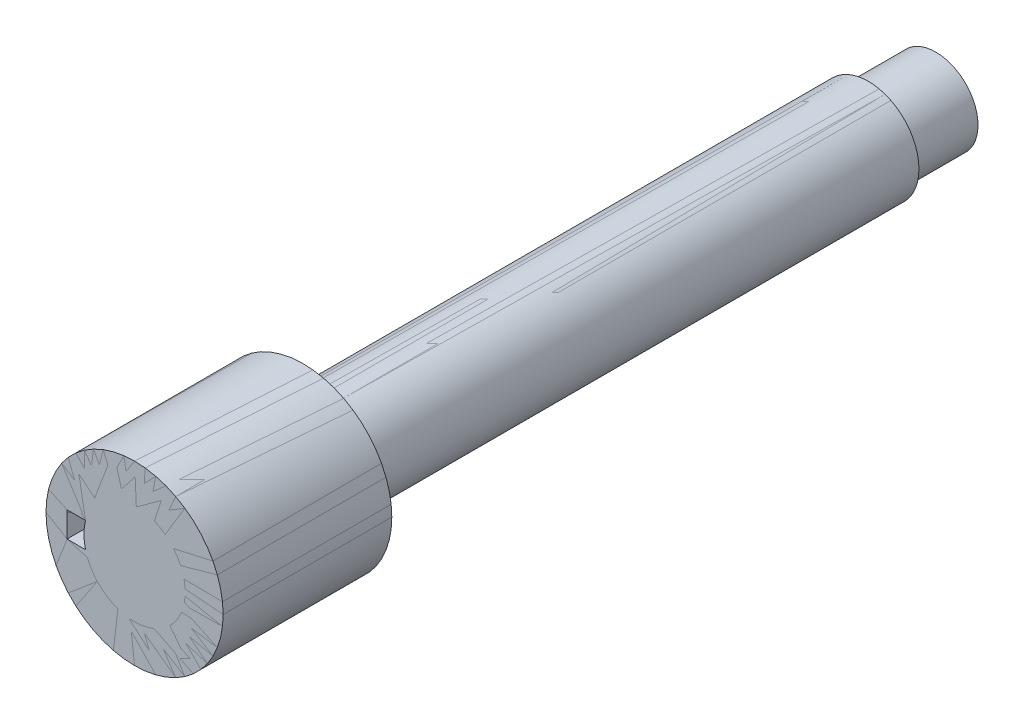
ISO-10303-21;
HEADER;
FILE_DESCRIPTION(('STEP AP214'),'2;1');
FILE_NAME('part.step','',(''),(''),'','','');
FILE_SCHEMA(('AUTOMOTIVE_DESIGN { 1 0 10303 214 1 1 1 1 }'));
ENDSEC;
DATA;
#1=APPLICATION_CONTEXT('core data for automotive mechanical design processes');
#2=APPLICATION_PROTOCOL_DEFINITION('international standard','automotive_design',2000,#1);
#3=PRODUCT_CONTEXT('',#1,'mechanical');
#4=PRODUCT('Part','Part','',(#3));
#5=PRODUCT_RELATED_PRODUCT_CATEGORY('part','',(#4));
#6=PRODUCT_DEFINITION_FORMATION('','',#4);
#7=PRODUCT_DEFINITION_CONTEXT('part definition',#1,'design');
#8=PRODUCT_DEFINITION('design','',#6,#7);
#9=PRODUCT_DEFINITION_SHAPE('','',#8);
#10=(LENGTH_UNIT() NAMED_UNIT(*) SI_UNIT(.MILLI.,.METRE.));
#11=(NAMED_UNIT(*) PLANE_ANGLE_UNIT() SI_UNIT($,.RADIAN.));
#12=(NAMED_UNIT(*) SI_UNIT($,.STERADIAN.) SOLID_ANGLE_UNIT());
#13=UNCERTAINTY_MEASURE_WITH_UNIT(LENGTH_MEASURE(1.E-05),#10,'distance_accuracy_value','');
#14=(GEOMETRIC_REPRESENTATION_CONTEXT(3) GLOBAL_UNCERTAINTY_ASSIGNED_CONTEXT((#13)) GLOBAL_UNIT_ASSIGNED_CONTEXT((#10,
#11,#12)) REPRESENTATION_CONTEXT('',''));
#15=CARTESIAN_POINT('',(0.,0.,0.));
#16=DIRECTION('',(0.,0.,1.));
#17=DIRECTION('',(1.,0.,0.));
#18=AXIS2_PLACEMENT_3D('',#15,#16,#17);
#19=CARTESIAN_POINT('',(0.,10.,-182.));
#20=DIRECTION('',(0.,0.,1.));
#21=DIRECTION('',(1.,0.,0.));
#22=AXIS2_PLACEMENT_3D('',#19,#20,#21);
#23=PLANE('',#22);
#24=CARTESIAN_POINT('',(0.,0.,-182.));
#25=DIRECTION('',(0.,0.,1.));
#26=DIRECTION('',(1.,0.,0.));
#27=AXIS2_PLACEMENT_3D('',#24,#25,#26);
#28=CIRCLE('',#27,12.);
#29=CARTESIAN_POINT('',(12.,0.,-182.));
#30=VERTEX_POINT('',#29);
#31=EDGE_CURVE('P0_E39',#30,#30,#28,.T.);
#32=ORIENTED_EDGE('',*,*,#31,.F.);
#33=EDGE_LOOP('',(#32));
#34=FACE_BOUND('',#33,.T.);
#35=CARTESIAN_POINT('',(0.,0.,-182.));
#36=DIRECTION('',(0.,0.,1.));
#37=DIRECTION('',(1.,0.,0.));
#38=AXIS2_PLACEMENT_3D('',#35,#36,#37);
#39=CIRCLE('',#38,10.);
#40=CARTESIAN_POINT('',(10.,0.,-182.));
#41=VERTEX_POINT('',#40);
#42=EDGE_CURVE('P0_E11',#41,#41,#39,.F.);
#43=ORIENTED_EDGE('',*,*,#42,.F.);
#44=EDGE_LOOP('',(#43));
#45=FACE_BOUND('',#44,.T.);
#46=ADVANCED_FACE('P0_F30',(#34,#45),#23,.F.);
#47=CARTESIAN_POINT('',(-10.,0.,0.));
#48=DIRECTION('',(1.,0.,0.));
#49=DIRECTION('',(0.,0.,-1.));
#50=AXIS2_PLACEMENT_3D('',#47,#48,#49);
#51=PLANE('',#50);
#52=DIRECTION('',(0.,0.,-1.));
#53=VECTOR('',#52,1.);
#54=CARTESIAN_POINT('',(-10.,3.,-50.));
#55=LINE('',#54,#53);
#56=CARTESIAN_POINT('',(-10.,2.99999999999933,-50.));
#57=VERTEX_POINT('',#56);
#58=CARTESIAN_POINT('',(-10.,3.,-43.));
#59=VERTEX_POINT('',#58);
#60=EDGE_CURVE('P0_E62',#57,#59,#55,.F.);
#61=ORIENTED_EDGE('',*,*,#60,.F.);
#62=CARTESIAN_POINT('',(-10.,-1.3433698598E-12,-50.));
#63=DIRECTION('',(1.,0.,0.));
#64=DIRECTION('',(0.,0.,-1.));
#65=AXIS2_PLACEMENT_3D('',#62,#63,#64);
#66=CIRCLE('',#65,3.);
#67=CARTESIAN_POINT('',(-10.,-3.00000000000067,-50.));
#68=VERTEX_POINT('',#67);
#69=EDGE_CURVE('P0_E170',#57,#68,#66,.F.);
#70=ORIENTED_EDGE('',*,*,#69,.T.);
#71=DIRECTION('',(0.,0.,1.));
#72=VECTOR('',#71,1.);
#73=CARTESIAN_POINT('',(-10.,-3.,-8.));
#74=LINE('',#73,#72);
#75=CARTESIAN_POINT('',(-10.,-3.,-43.));
#76=VERTEX_POINT('',#75);
#77=EDGE_CURVE('P0_E141',#76,#68,#74,.F.);
#78=ORIENTED_EDGE('',*,*,#77,.F.);
#79=DIRECTION('',(0.,1.,0.));
#80=VECTOR('',#79,1.);
#81=CARTESIAN_POINT('',(-10.,0.,-43.));
#82=LINE('',#81,#80);
#83=EDGE_CURVE('P0_E70',#59,#76,#82,.F.);
#84=ORIENTED_EDGE('',*,*,#83,.F.);
#85=EDGE_LOOP('',(#61,#70,#78,#84));
#86=FACE_BOUND('',#85,.T.);
#87=ADVANCED_FACE('P0_F237',(#86),#51,.F.);
#88=CARTESIAN_POINT('',(-10.,3.,-50.));
#89=DIRECTION('',(0.,-1.,0.));
#90=DIRECTION('',(0.,0.,-1.));
#91=AXIS2_PLACEMENT_3D('',#88,#89,#90);
#92=PLANE('',#91);
#93=DIRECTION('',(1.,0.,0.));
#94=VECTOR('',#93,1.);
#95=CARTESIAN_POINT('',(0.,3.,-43.));
#96=LINE('',#95,#94);
#97=CARTESIAN_POINT('',(-11.6189500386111,3.,-43.));
#98=VERTEX_POINT('',#97);
#99=EDGE_CURVE('P0_E121',#98,#59,#96,.T.);
#100=ORIENTED_EDGE('',*,*,#99,.F.);
#101=DIRECTION('',(0.,0.,-1.));
#102=VECTOR('',#101,1.);
#103=CARTESIAN_POINT('',(-11.6189500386,3.,-50.));
#104=LINE('',#103,#102);
#105=CARTESIAN_POINT('',(-11.6189500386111,3.,-7.99999999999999));
#106=VERTEX_POINT('',#105);
#107=EDGE_CURVE('P0_E107',#98,#106,#104,.F.);
#108=ORIENTED_EDGE('',*,*,#107,.T.);
#109=DIRECTION('',(1.,0.,0.));
#110=VECTOR('',#109,1.);
#111=CARTESIAN_POINT('',(0.,3.,-8.));
#112=LINE('',#111,#110);
#113=CARTESIAN_POINT('',(-16.,3.,-8.));
#114=VERTEX_POINT('',#113);
#115=EDGE_CURVE('P0_E117',#114,#106,#112,.T.);
#116=ORIENTED_EDGE('',*,*,#115,.F.);
#117=DIRECTION('',(0.,0.,-1.));
#118=VECTOR('',#117,1.);
#119=CARTESIAN_POINT('',(-16.,3.,0.));
#120=LINE('',#119,#118);
#121=CARTESIAN_POINT('',(-16.,2.99999999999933,-50.));
#122=VERTEX_POINT('',#121);
#123=EDGE_CURVE('P0_E152',#122,#114,#120,.F.);
#124=ORIENTED_EDGE('',*,*,#123,.F.);
#125=DIRECTION('',(1.,0.,0.));
#126=VECTOR('',#125,1.);
#127=CARTESIAN_POINT('',(-13.,2.99999999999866,-50.));
#128=LINE('',#127,#126);
#129=EDGE_CURVE('P0_E181',#122,#57,#128,.T.);
#130=ORIENTED_EDGE('',*,*,#129,.T.);
#131=ORIENTED_EDGE('',*,*,#60,.T.);
#132=EDGE_LOOP('',(#100,#108,#116,#124,#130,#131));
#133=FACE_BOUND('',#132,.T.);
#134=ADVANCED_FACE('P0_F125',(#133),#92,.T.);
#135=CARTESIAN_POINT('',(0.,21.,-8.));
#136=DIRECTION('',(0.,0.,1.));
#137=DIRECTION('',(1.,0.,0.));
#138=AXIS2_PLACEMENT_3D('',#135,#136,#137);
#139=PLANE('',#138);
#140=CARTESIAN_POINT('',(0.,0.,-7.99999999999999));
#141=DIRECTION('',(0.,0.,1.));
#142=DIRECTION('',(1.,0.,0.));
#143=AXIS2_PLACEMENT_3D('',#140,#141,#142);
#144=CIRCLE('',#143,11.9999999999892);
#145=CARTESIAN_POINT('',(-11.6189500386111,-3.,-7.99999999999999));
#146=VERTEX_POINT('',#145);
#147=EDGE_CURVE('P0_E112',#146,#106,#144,.T.);
#148=ORIENTED_EDGE('',*,*,#147,.F.);
#149=DIRECTION('',(1.,0.,0.));
#150=VECTOR('',#149,1.);
#151=CARTESIAN_POINT('',(-10.,-3.,-8.));
#152=LINE('',#151,#150);
#153=CARTESIAN_POINT('',(-16.,-3.,-8.));
#154=VERTEX_POINT('',#153);
#155=EDGE_CURVE('P0_E90',#154,#146,#152,.T.);
#156=ORIENTED_EDGE('',*,*,#155,.F.);
#157=DIRECTION('',(0.,1.,0.));
#158=VECTOR('',#157,1.);
#159=CARTESIAN_POINT('',(-16.,0.,-8.));
#160=LINE('',#159,#158);
#161=EDGE_CURVE('P0_E149',#114,#154,#160,.F.);
#162=ORIENTED_EDGE('',*,*,#161,.F.);
#163=ORIENTED_EDGE('',*,*,#115,.T.);
#164=EDGE_LOOP('',(#148,#156,#162,#163));
#165=FACE_BOUND('',#164,.T.);
#166=CARTESIAN_POINT('',(0.,0.,-7.99999999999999));
#167=DIRECTION('',(0.,0.,1.));
#168=DIRECTION('',(1.,0.,0.));
#169=AXIS2_PLACEMENT_3D('',#166,#167,#168);
#170=CIRCLE('',#169,21.);
#171=CARTESIAN_POINT('',(21.,0.,-7.99999999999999));
#172=VERTEX_POINT('',#171);
#173=EDGE_CURVE('P0_E184',#172,#172,#170,.F.);
#174=ORIENTED_EDGE('',*,*,#173,.F.);
#175=EDGE_LOOP('',(#174));
#176=FACE_BOUND('',#175,.T.);
#177=ADVANCED_FACE('P0_F232',(#165,#176),#139,.T.);
#178=CARTESIAN_POINT('',(-10.,-3.,-8.));
#179=DIRECTION('',(0.,1.,0.));
#180=DIRECTION('',(0.,0.,1.));
#181=AXIS2_PLACEMENT_3D('',#178,#179,#180);
#182=PLANE('',#181);
#183=DIRECTION('',(0.,0.,1.));
#184=VECTOR('',#183,1.);
#185=CARTESIAN_POINT('',(-11.6189500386,-3.,-8.));
#186=LINE('',#185,#184);
#187=CARTESIAN_POINT('',(-11.6189500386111,-3.,-43.));
#188=VERTEX_POINT('',#187);
#189=EDGE_CURVE('P0_E173',#146,#188,#186,.F.);
#190=ORIENTED_EDGE('',*,*,#189,.T.);
#191=DIRECTION('',(1.,0.,0.));
#192=VECTOR('',#191,1.);
#193=CARTESIAN_POINT('',(0.,-3.,-43.));
#194=LINE('',#193,#192);
#195=EDGE_CURVE('P0_E122',#76,#188,#194,.F.);
#196=ORIENTED_EDGE('',*,*,#195,.F.);
#197=ORIENTED_EDGE('',*,*,#77,.T.);
#198=DIRECTION('',(1.,0.,0.));
#199=VECTOR('',#198,1.);
#200=CARTESIAN_POINT('',(-13.,-3.00000000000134,-50.));
#201=LINE('',#200,#199);
#202=CARTESIAN_POINT('',(-16.,-3.00000000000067,-50.));
#203=VERTEX_POINT('',#202);
#204=EDGE_CURVE('P0_E83',#68,#203,#201,.F.);
#205=ORIENTED_EDGE('',*,*,#204,.T.);
#206=DIRECTION('',(0.,0.,-1.));
#207=VECTOR('',#206,1.);
#208=CARTESIAN_POINT('',(-16.,-3.,0.));
#209=LINE('',#208,#207);
#210=EDGE_CURVE('P0_E144',#154,#203,#209,.T.);
#211=ORIENTED_EDGE('',*,*,#210,.F.);
#212=ORIENTED_EDGE('',*,*,#155,.T.);
#213=EDGE_LOOP('',(#190,#196,#197,#205,#211,#212));
#214=FACE_BOUND('',#213,.T.);
#215=ADVANCED_FACE('P0_F228',(#214),#182,.T.);
#216=CARTESIAN_POINT('',(0.,0.,-123.098076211));
#217=DIRECTION('',(0.,0.,1.));
#218=DIRECTION('',(1.,0.,0.));
#219=AXIS2_PLACEMENT_3D('',#216,#217,#218);
#220=CYLINDRICAL_SURFACE('',#219,21.);
#221=ORIENTED_EDGE('',*,*,#173,.T.);
#222=EDGE_LOOP('',(#221));
#223=FACE_BOUND('',#222,.T.);
#224=CARTESIAN_POINT('',(0.,0.,-47.9999999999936));
#225=DIRECTION('',(0.,0.,1.));
#226=DIRECTION('',(-0.479425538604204,0.877582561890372,0.));
#227=AXIS2_PLACEMENT_3D('',#224,#225,#226);
#228=CIRCLE('',#227,21.0000000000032);
#229=CARTESIAN_POINT('',(-10.0679363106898,18.4292337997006,-47.9999999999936));
#230=VERTEX_POINT('',#229);
#231=EDGE_CURVE('P0_E163',#230,#230,#228,.F.);
#232=ORIENTED_EDGE('',*,*,#231,.F.);
#233=EDGE_LOOP('',(#232));
#234=FACE_BOUND('',#233,.T.);
#235=ADVANCED_FACE('P0_F225',(#223,#234),#220,.T.);
#236=CARTESIAN_POINT('',(-13.,-1.3433698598E-12,-50.));
#237=DIRECTION('',(1.,0.,0.));
#238=DIRECTION('',(0.,0.,-1.));
#239=AXIS2_PLACEMENT_3D('',#236,#237,#238);
#240=CYLINDRICAL_SURFACE('',#239,3.);
#241=CARTESIAN_POINT('',(-16.,-1.3433698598E-12,-50.));
#242=DIRECTION('',(1.,0.,0.));
#243=DIRECTION('',(0.,0.,-1.));
#244=AXIS2_PLACEMENT_3D('',#241,#242,#243);
#245=CIRCLE('',#244,3.);
#246=CARTESIAN_POINT('',(-15.9999999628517,-2.75998137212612,-51.175798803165));
#247=VERTEX_POINT('',#246);
#248=EDGE_CURVE('P0_E148',#203,#247,#245,.T.);
#249=ORIENTED_EDGE('',*,*,#248,.F.);
#250=ORIENTED_EDGE('',*,*,#204,.F.);
#251=ORIENTED_EDGE('',*,*,#69,.F.);
#252=ORIENTED_EDGE('',*,*,#129,.F.);
#253=CARTESIAN_POINT('',(-16.,-1.3433698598E-12,-50.));
#254=DIRECTION('',(1.,0.,0.));
#255=DIRECTION('',(0.,0.,-1.));
#256=AXIS2_PLACEMENT_3D('',#253,#254,#255);
#257=CIRCLE('',#256,3.);
#258=CARTESIAN_POINT('',(-16.,2.75998135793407,-51.1757987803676));
#259=VERTEX_POINT('',#258);
#260=EDGE_CURVE('P0_E47',#259,#122,#257,.T.);
#261=ORIENTED_EDGE('',*,*,#260,.F.);
#262=CARTESIAN_POINT('',(-15.9999999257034,-2.75998136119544,-51.1757988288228));
#263=CARTESIAN_POINT('',(-15.9309307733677,-2.73966577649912,-51.2234764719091));
#264=CARTESIAN_POINT('',(-15.8622271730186,-2.71793414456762,-51.271071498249));
#265=CARTESIAN_POINT('',(-15.725651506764,-2.67146931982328,-51.3660349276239));
#266=CARTESIAN_POINT('',(-15.6577797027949,-2.64673520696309,-51.413403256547));
#267=CARTESIAN_POINT('',(-15.4548932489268,-2.56750856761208,-51.55554559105));
#268=CARTESIAN_POINT('',(-15.3213616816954,-2.50820902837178,-51.6498365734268));
#269=CARTESIAN_POINT('',(-15.0576236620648,-2.37417611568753,-51.8376151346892));
#270=CARTESIAN_POINT('',(-14.9275113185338,-2.29919923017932,-51.9310623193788));
#271=CARTESIAN_POINT('',(-14.6755467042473,-2.13254954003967,-52.1136382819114));
#272=CARTESIAN_POINT('',(-14.5536737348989,-2.04092088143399,-52.2027777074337));
#273=CARTESIAN_POINT('',(-14.3888878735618,-1.89744045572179,-52.3243916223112));
#274=CARTESIAN_POINT('',(-14.3412214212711,-1.8533901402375,-52.3597114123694));
#275=CARTESIAN_POINT('',(-14.2482390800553,-1.76178249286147,-52.4288715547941));
#276=CARTESIAN_POINT('',(-14.2029232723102,-1.71422503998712,-52.4627118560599));
#277=CARTESIAN_POINT('',(-14.0712958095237,-1.5663252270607,-52.5613793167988));
#278=CARTESIAN_POINT('',(-13.9890050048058,-1.46050065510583,-52.6235741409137));
#279=CARTESIAN_POINT('',(-13.8380629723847,-1.2319104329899,-52.738414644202));
#280=CARTESIAN_POINT('',(-13.769620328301,-1.10892703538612,-52.7909133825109));
#281=CARTESIAN_POINT('',(-13.6822764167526,-0.913846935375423,-52.8582551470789));
#282=CARTESIAN_POINT('',(-13.6557222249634,-0.847079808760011,-52.8787957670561));
#283=CARTESIAN_POINT('',(-13.6083374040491,-0.710411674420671,-52.9155307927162));
#284=CARTESIAN_POINT('',(-13.587504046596,-0.640512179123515,-52.9317272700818));
#285=CARTESIAN_POINT('',(-13.5447311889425,-0.468154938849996,-52.9650319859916));
#286=CARTESIAN_POINT('',(-13.5260149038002,-0.364373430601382,-52.9796562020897));
#287=CARTESIAN_POINT('',(-13.5027028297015,-0.154327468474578,-52.9978808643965));
#288=CARTESIAN_POINT('',(-13.4980993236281,-0.0480644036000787,-53.0014873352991));
#289=CARTESIAN_POINT('',(-13.5033301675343,0.163922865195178,-52.9973939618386));
#290=CARTESIAN_POINT('',(-13.5131698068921,0.269646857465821,-52.989689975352));
#291=CARTESIAN_POINT('',(-13.5465737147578,0.477531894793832,-52.9636052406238));
#292=CARTESIAN_POINT('',(-13.5701435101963,0.579691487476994,-52.9452201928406));
#293=CARTESIAN_POINT('',(-13.6299030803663,0.779563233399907,-52.8987877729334));
#294=CARTESIAN_POINT('',(-13.6662711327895,0.877189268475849,-52.8706039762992));
#295=CARTESIAN_POINT('',(-13.7495708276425,1.06498520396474,-52.8063633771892));
#296=CARTESIAN_POINT('',(-13.7965064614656,1.15515226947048,-52.7703036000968));
#297=CARTESIAN_POINT('',(-13.92950300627,1.37872341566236,-52.6686890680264));
#298=CARTESIAN_POINT('',(-14.0222392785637,1.50597892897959,-52.5983410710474));
#299=CARTESIAN_POINT('',(-14.2232421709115,1.74071438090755,-52.4473484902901));
#300=CARTESIAN_POINT('',(-14.3315554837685,1.8481325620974,-52.3666730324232));
#301=CARTESIAN_POINT('',(-14.5353619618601,2.02445325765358,-52.2163181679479));
#302=CARTESIAN_POINT('',(-14.6288697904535,2.09672612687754,-52.1478180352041));
#303=CARTESIAN_POINT('',(-14.8211084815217,2.2309885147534,-52.0080075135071));
#304=CARTESIAN_POINT('',(-14.9198428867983,2.29297093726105,-51.9366952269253));
#305=CARTESIAN_POINT('',(-15.1213156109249,2.40761367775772,-51.7921791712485));
#306=CARTESIAN_POINT('',(-15.2240563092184,2.46026834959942,-51.7189742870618));
#307=CARTESIAN_POINT('',(-15.4325554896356,2.5570600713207,-51.5713775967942));
#308=CARTESIAN_POINT('',(-15.5383126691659,2.60120073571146,-51.4969863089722));
#309=CARTESIAN_POINT('',(-15.7038195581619,2.66350246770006,-51.3812732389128));
#310=CARTESIAN_POINT('',(-15.7627460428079,2.6843848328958,-51.340210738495));
#311=CARTESIAN_POINT('',(-15.8810260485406,2.72385267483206,-51.2580515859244));
#312=CARTESIAN_POINT('',(-15.9403774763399,2.74244561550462,-51.2169555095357));
#313=CARTESIAN_POINT('',(-15.9999999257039,2.75998136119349,-51.1757988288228));
#314=B_SPLINE_CURVE_WITH_KNOTS('',3,(#262,#263,#264,#265,#266,#267,#268,#269,#270,#271,#272,
#273,#274,#275,#276,#277,#278,#279,#280,#281,#282,#283,#284,#285,#286,#287,#288,#289,#290,#291,
#292,#293,#294,#295,#296,#297,#298,#299,#300,#301,#302,#303,#304,#305,#306,#307,#308,#309,#310,
#311,#312,#313),.UNSPECIFIED.,.F.,.F.,(4,2,2,2,2,2,2,2,2,2,2,2,2,2,2,2,2,2,2,2,2,2,2,2,2,4),(0.,
0.259025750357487,0.518131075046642,1.03915973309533,1.56897891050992,2.09741343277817,
2.31897362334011,2.54054146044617,2.98233451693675,3.4303542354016,3.65419596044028,
3.87793074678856,4.19580853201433,4.51351246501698,4.83133277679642,5.14928111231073,
5.47184618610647,5.79453329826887,6.30898324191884,6.82500871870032,7.2342493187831,
7.64377096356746,8.05353965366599,8.46313399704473,8.6874927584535,8.91109953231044),.UNSPECIFIED.);
#315=EDGE_CURVE('P0_E167',#247,#259,#314,.T.);
#316=ORIENTED_EDGE('',*,*,#315,.F.);
#317=EDGE_LOOP('',(#249,#250,#251,#252,#261,#316));
#318=FACE_BOUND('',#317,.T.);
#319=ADVANCED_FACE('P0_F220',(#318),#240,.F.);
#320=CARTESIAN_POINT('',(-16.,0.,0.));
#321=DIRECTION('',(1.,0.,0.));
#322=DIRECTION('',(0.,0.,-1.));
#323=AXIS2_PLACEMENT_3D('',#320,#321,#322);
#324=PLANE('',#323);
#325=ORIENTED_EDGE('',*,*,#248,.T.);
#326=CARTESIAN_POINT('',(-16.,2.75998133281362,-51.175798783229));
#327=CARTESIAN_POINT('',(-16.,2.53058008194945,-51.2018013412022));
#328=CARTESIAN_POINT('',(-16.,2.30083283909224,-51.2246834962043));
#329=CARTESIAN_POINT('',(-16.,1.84078348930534,-51.2640482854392));
#330=CARTESIAN_POINT('',(-16.,1.61048136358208,-51.2805306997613));
#331=CARTESIAN_POINT('',(-16.,0.920517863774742,-51.3200493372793));
#332=CARTESIAN_POINT('',(-16.,0.460258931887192,-51.3333333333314));
#333=CARTESIAN_POINT('',(-16.,-0.460258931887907,-51.3333333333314));
#334=CARTESIAN_POINT('',(-16.,-0.920517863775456,-51.3200493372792));
#335=CARTESIAN_POINT('',(-16.,-1.6104813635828,-51.2805306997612));
#336=CARTESIAN_POINT('',(-16.,-1.84078348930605,-51.2640482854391));
#337=CARTESIAN_POINT('',(-16.,-2.30083283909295,-51.2246834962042));
#338=CARTESIAN_POINT('',(-16.,-2.53058008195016,-51.2018013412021));
#339=CARTESIAN_POINT('',(-16.,-2.75998133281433,-51.175798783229));
#340=B_SPLINE_CURVE_WITH_KNOTS('',3,(#326,#327,#328,#329,#330,#331,#332,#333,#334,#335,#336,
#337,#338,#339),.UNSPECIFIED.,.F.,.F.,(4,2,2,2,2,2,4),(0.,0.692571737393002,1.38516727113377,
2.76571360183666,4.14625993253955,4.83885546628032,5.53142720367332),.UNSPECIFIED.);
#341=EDGE_CURVE('P0_E162',#259,#247,#340,.T.);
#342=ORIENTED_EDGE('',*,*,#341,.F.);
#343=ORIENTED_EDGE('',*,*,#260,.T.);
#344=ORIENTED_EDGE('',*,*,#123,.T.);
#345=ORIENTED_EDGE('',*,*,#161,.T.);
#346=ORIENTED_EDGE('',*,*,#210,.T.);
#347=EDGE_LOOP('',(#325,#342,#343,#344,#345,#346));
#348=FACE_BOUND('',#347,.T.);
#349=ADVANCED_FACE('P0_F217',(#348),#324,.T.);
#350=CARTESIAN_POINT('',(0.,0.,-47.9999999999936));
#351=DIRECTION('',(0.,0.,1.));
#352=DIRECTION('',(1.,0.,0.));
#353=AXIS2_PLACEMENT_3D('',#350,#351,#352);
#354=CONICAL_SURFACE('',#353,21.0000000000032,0.982793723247);
#355=ORIENTED_EDGE('',*,*,#231,.T.);
#356=EDGE_LOOP('',(#355));
#357=FACE_BOUND('',#356,.T.);
#358=ORIENTED_EDGE('',*,*,#315,.T.);
#359=ORIENTED_EDGE('',*,*,#341,.T.);
#360=EDGE_LOOP('',(#358,#359));
#361=FACE_BOUND('',#360,.T.);
#362=CARTESIAN_POINT('',(0.,0.,-54.));
#363=DIRECTION('',(0.,0.,1.));
#364=DIRECTION('',(1.,0.,0.));
#365=AXIS2_PLACEMENT_3D('',#362,#363,#364);
#366=CIRCLE('',#365,12.);
#367=CARTESIAN_POINT('',(12.,0.,-54.));
#368=VERTEX_POINT('',#367);
#369=EDGE_CURVE('P0_E158',#368,#368,#366,.F.);
#370=ORIENTED_EDGE('',*,*,#369,.F.);
#371=EDGE_LOOP('',(#370));
#372=FACE_BOUND('',#371,.T.);
#373=ADVANCED_FACE('P0_F215',(#357,#361,#372),#354,.T.);
#374=CARTESIAN_POINT('',(0.,0.,-123.098076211));
#375=DIRECTION('',(0.,0.,1.));
#376=DIRECTION('',(1.,0.,0.));
#377=AXIS2_PLACEMENT_3D('',#374,#375,#376);
#378=CYLINDRICAL_SURFACE('',#377,12.);
#379=ORIENTED_EDGE('',*,*,#369,.T.);
#380=EDGE_LOOP('',(#379));
#381=FACE_BOUND('',#380,.T.);
#382=ORIENTED_EDGE('',*,*,#31,.T.);
#383=EDGE_LOOP('',(#382));
#384=FACE_BOUND('',#383,.T.);
#385=ADVANCED_FACE('P0_F32',(#381,#384),#378,.T.);
#386=CARTESIAN_POINT('',(0.,0.,-198.));
#387=DIRECTION('',(0.,0.,1.));
#388=DIRECTION('',(1.,0.,0.));
#389=AXIS2_PLACEMENT_3D('',#386,#387,#388);
#390=CYLINDRICAL_SURFACE('',#389,10.);
#391=CARTESIAN_POINT('',(0.,0.,-198.));
#392=DIRECTION('',(0.,0.,-1.));
#393=DIRECTION('',(-1.,0.,0.));
#394=AXIS2_PLACEMENT_3D('',#391,#392,#393);
#395=CIRCLE('',#394,10.);
#396=CARTESIAN_POINT('',(-10.,0.,-198.));
#397=VERTEX_POINT('',#396);
#398=EDGE_CURVE('P0_E127',#397,#397,#395,.T.);
#399=ORIENTED_EDGE('',*,*,#398,.F.);
#400=EDGE_LOOP('',(#399));
#401=FACE_BOUND('',#400,.T.);
#402=ORIENTED_EDGE('',*,*,#42,.T.);
#403=EDGE_LOOP('',(#402));
#404=FACE_BOUND('',#403,.T.);
#405=ADVANCED_FACE('P0_F240',(#401,#404),#390,.T.);
#406=CARTESIAN_POINT('',(0.,0.,-198.));
#407=DIRECTION('',(0.,0.,-1.));
#408=DIRECTION('',(-1.,0.,0.));
#409=AXIS2_PLACEMENT_3D('',#406,#407,#408);
#410=PLANE('',#409);
#411=ORIENTED_EDGE('',*,*,#398,.T.);
#412=EDGE_LOOP('',(#411));
#413=FACE_BOUND('',#412,.T.);
#414=ADVANCED_FACE('P0_F262',(#413),#410,.T.);
#415=CARTESIAN_POINT('',(11.9999999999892,0.,-43.));
#416=DIRECTION('',(0.,0.,-1.));
#417=DIRECTION('',(-1.,0.,0.));
#418=AXIS2_PLACEMENT_3D('',#415,#416,#417);
#419=PLANE('',#418);
#420=ORIENTED_EDGE('',*,*,#99,.T.);
#421=ORIENTED_EDGE('',*,*,#83,.T.);
#422=ORIENTED_EDGE('',*,*,#195,.T.);
#423=CARTESIAN_POINT('',(0.,0.,-43.));
#424=DIRECTION('',(0.,0.,1.));
#425=DIRECTION('',(1.,0.,0.));
#426=AXIS2_PLACEMENT_3D('',#423,#424,#425);
#427=CIRCLE('',#426,11.9999999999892);
#428=EDGE_CURVE('P0_E110',#188,#98,#427,.T.);
#429=ORIENTED_EDGE('',*,*,#428,.T.);
#430=EDGE_LOOP('',(#420,#421,#422,#429));
#431=FACE_BOUND('',#430,.T.);
#432=CARTESIAN_POINT('',(0.,0.,-43.));
#433=DIRECTION('',(0.,0.,-1.));
#434=DIRECTION('',(-1.,0.,0.));
#435=AXIS2_PLACEMENT_3D('',#432,#433,#434);
#436=CIRCLE('',#435,3.00000000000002);
#437=CARTESIAN_POINT('',(-3.00000000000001,0.,-43.));
#438=VERTEX_POINT('',#437);
#439=EDGE_CURVE('P0_E123',#438,#438,#436,.F.);
#440=ORIENTED_EDGE('',*,*,#439,.F.);
#441=EDGE_LOOP('',(#440));
#442=FACE_BOUND('',#441,.T.);
#443=ADVANCED_FACE('P0_F119',(#431,#442),#419,.F.);
#444=CARTESIAN_POINT('',(0.,0.,-43.));
#445=DIRECTION('',(0.,0.,1.));
#446=DIRECTION('',(1.,0.,0.));
#447=AXIS2_PLACEMENT_3D('',#444,#445,#446);
#448=CYLINDRICAL_SURFACE('',#447,11.9999999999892);
#449=ORIENTED_EDGE('',*,*,#107,.F.);
#450=ORIENTED_EDGE('',*,*,#428,.F.);
#451=ORIENTED_EDGE('',*,*,#189,.F.);
#452=ORIENTED_EDGE('',*,*,#147,.T.);
#453=EDGE_LOOP('',(#449,#450,#451,#452));
#454=FACE_BOUND('',#453,.T.);
#455=ADVANCED_FACE('P0_F109',(#454),#448,.F.);
#456=CARTESIAN_POINT('',(0.,0.,-48.1961524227));
#457=CARTESIAN_POINT('',(0.,1.36034952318,-47.4107542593));
#458=CARTESIAN_POINT('',(0.,2.44947111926,-46.1462536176));
#459=CARTESIAN_POINT('',(0.,3.,-44.5707963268));
#460=CARTESIAN_POINT('',(0.,3.,-43.));
#461=(BOUNDED_CURVE() B_SPLINE_CURVE(4,(#456,#457,#458,#459,#460),.UNSPECIFIED.,.F.,
.F.) B_SPLINE_CURVE_WITH_KNOTS((5,5),(3.14159265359,9.42477796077),
.UNSPECIFIED.) CURVE() GEOMETRIC_REPRESENTATION_ITEM() RATIONAL_B_SPLINE_CURVE((1.,1.,1.,1.,1.)) REPRESENTATION_ITEM(''));
#462=CARTESIAN_POINT('',(0.,0.,-123.098076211));
#463=DIRECTION('',(0.,0.,-1.));
#464=AXIS1_PLACEMENT('',#462,#463);
#465=SURFACE_OF_REVOLUTION('',#461,#464);
#466=ORIENTED_EDGE('',*,*,#439,.T.);
#467=EDGE_LOOP('',(#466));
#468=FACE_BOUND('',#467,.T.);
#469=CARTESIAN_POINT('',(0.,0.,-48.1961524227));
#470=VERTEX_POINT('',#469);
#471=VERTEX_LOOP('',#470);
#472=FACE_BOUND('',#471,.T.);
#473=ADVANCED_FACE('P0_F241',(#468,#472),#465,.T.);
#474=CLOSED_SHELL('',(#46,#87,#134,#177,#215,#235,#319,#349,#373,#385,#405,#414,#443,#455,#473));
#475=MANIFOLD_SOLID_BREP('P0_B2',#474);
#476=CARTESIAN_POINT('',(-10.,0.,0.));
#477=DIRECTION('',(1.,0.,0.));
#478=DIRECTION('',(0.,0.,-1.));
#479=AXIS2_PLACEMENT_3D('',#476,#477,#478);
#480=PLANE('',#479);
#481=DIRECTION('',(0.,0.,-1.));
#482=VECTOR('',#481,1.);
#483=CARTESIAN_POINT('',(-10.,3.,-50.));
#484=LINE('',#483,#482);
#485=CARTESIAN_POINT('',(-10.,2.99999999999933,-50.));
#486=VERTEX_POINT('',#485);
#487=CARTESIAN_POINT('',(-10.,3.,-43.));
#488=VERTEX_POINT('',#487);
#489=EDGE_CURVE('P1_E236',#486,#488,#484,.F.);
#490=ORIENTED_EDGE('',*,*,#489,.F.);
#491=CARTESIAN_POINT('',(-10.,-1.3433698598E-12,-50.));
#492=DIRECTION('',(1.,0.,0.));
#493=DIRECTION('',(0.,0.,-1.));
#494=AXIS2_PLACEMENT_3D('',#491,#492,#493);
#495=CIRCLE('',#494,3.);
#496=CARTESIAN_POINT('',(-10.,-3.00000000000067,-50.));
#497=VERTEX_POINT('',#496);
#498=EDGE_CURVE('P1_E213',#486,#497,#495,.F.);
#499=ORIENTED_EDGE('',*,*,#498,.T.);
#500=DIRECTION('',(0.,0.,1.));
#501=VECTOR('',#500,1.);
#502=CARTESIAN_POINT('',(-10.,-3.,-8.));
#503=LINE('',#502,#501);
#504=CARTESIAN_POINT('',(-10.,-3.,-43.));
#505=VERTEX_POINT('',#504);
#506=EDGE_CURVE('P1_E216',#505,#497,#503,.F.);
#507=ORIENTED_EDGE('',*,*,#506,.F.);
#508=DIRECTION('',(0.,1.,0.));
#509=VECTOR('',#508,1.);
#510=CARTESIAN_POINT('',(-10.,0.,-43.));
#511=LINE('',#510,#509);
#512=EDGE_CURVE('P1_E76',#488,#505,#511,.F.);
#513=ORIENTED_EDGE('',*,*,#512,.F.);
#514=EDGE_LOOP('',(#490,#499,#507,#513));
#515=FACE_BOUND('',#514,.T.);
#516=ADVANCED_FACE('P1_F17',(#515),#480,.F.);
#517=CARTESIAN_POINT('',(-10.,3.,-50.));
#518=DIRECTION('',(0.,-1.,0.));
#519=DIRECTION('',(0.,0.,-1.));
#520=AXIS2_PLACEMENT_3D('',#517,#518,#519);
#521=PLANE('',#520);
#522=DIRECTION('',(1.,0.,0.));
#523=VECTOR('',#522,1.);
#524=CARTESIAN_POINT('',(0.,3.,-43.));
#525=LINE('',#524,#523);
#526=CARTESIAN_POINT('',(-11.6189500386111,3.,-43.));
#527=VERTEX_POINT('',#526);
#528=EDGE_CURVE('P1_E69',#527,#488,#525,.T.);
#529=ORIENTED_EDGE('',*,*,#528,.F.);
#530=DIRECTION('',(0.,0.,-1.));
#531=VECTOR('',#530,1.);
#532=CARTESIAN_POINT('',(-11.6189500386,3.,-50.));
#533=LINE('',#532,#531);
#534=CARTESIAN_POINT('',(-11.6189500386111,3.,-8.));
#535=VERTEX_POINT('',#534);
#536=EDGE_CURVE('P1_E62',#527,#535,#533,.F.);
#537=ORIENTED_EDGE('',*,*,#536,.T.);
#538=DIRECTION('',(1.,0.,0.));
#539=VECTOR('',#538,1.);
#540=CARTESIAN_POINT('',(0.,3.,-8.));
#541=LINE('',#540,#539);
#542=CARTESIAN_POINT('',(-16.,3.,-8.));
#543=VERTEX_POINT('',#542);
#544=EDGE_CURVE('P1_E233',#543,#535,#541,.T.);
#545=ORIENTED_EDGE('',*,*,#544,.F.);
#546=DIRECTION('',(0.,0.,-1.));
#547=VECTOR('',#546,1.);
#548=CARTESIAN_POINT('',(-16.,3.,0.));
#549=LINE('',#548,#547);
#550=CARTESIAN_POINT('',(-16.,2.99999999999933,-50.));
#551=VERTEX_POINT('',#550);
#552=EDGE_CURVE('P1_E224',#551,#543,#549,.F.);
#553=ORIENTED_EDGE('',*,*,#552,.F.);
#554=DIRECTION('',(1.,0.,0.));
#555=VECTOR('',#554,1.);
#556=CARTESIAN_POINT('',(-13.,2.99999999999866,-50.));
#557=LINE('',#556,#555);
#558=EDGE_CURVE('P1_E227',#551,#486,#557,.T.);
#559=ORIENTED_EDGE('',*,*,#558,.T.);
#560=ORIENTED_EDGE('',*,*,#489,.T.);
#561=EDGE_LOOP('',(#529,#537,#545,#553,#559,#560));
#562=FACE_BOUND('',#561,.T.);
#563=ADVANCED_FACE('P1_F139',(#562),#521,.T.);
#564=CARTESIAN_POINT('',(0.,21.,-8.));
#565=DIRECTION('',(0.,0.,1.));
#566=DIRECTION('',(1.,0.,0.));
#567=AXIS2_PLACEMENT_3D('',#564,#565,#566);
#568=PLANE('',#567);
#569=DIRECTION('',(0.,1.,0.));
#570=VECTOR('',#569,1.);
#571=CARTESIAN_POINT('',(-16.,0.,-8.));
#572=LINE('',#571,#570);
#573=CARTESIAN_POINT('',(-16.,-3.,-8.));
#574=VERTEX_POINT('',#573);
#575=EDGE_CURVE('P1_E219',#543,#574,#572,.F.);
#576=ORIENTED_EDGE('',*,*,#575,.F.);
#577=ORIENTED_EDGE('',*,*,#544,.T.);
#578=CARTESIAN_POINT('',(0.,0.,-7.99999999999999));
#579=DIRECTION('',(0.,0.,1.));
#580=DIRECTION('',(1.,0.,0.));
#581=AXIS2_PLACEMENT_3D('',#578,#579,#580);
#582=CIRCLE('',#581,11.9999999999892);
#583=CARTESIAN_POINT('',(-11.6189500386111,-3.,-8.));
#584=VERTEX_POINT('',#583);
#585=EDGE_CURVE('P1_E115',#535,#584,#582,.T.);
#586=ORIENTED_EDGE('',*,*,#585,.T.);
#587=DIRECTION('',(1.,0.,0.));
#588=VECTOR('',#587,1.);
#589=CARTESIAN_POINT('',(-10.,-3.,-8.));
#590=LINE('',#589,#588);
#591=EDGE_CURVE('P1_E94',#574,#584,#590,.T.);
#592=ORIENTED_EDGE('',*,*,#591,.F.);
#593=EDGE_LOOP('',(#576,#577,#586,#592));
#594=FACE_BOUND('',#593,.T.);
#595=CARTESIAN_POINT('',(0.,0.,-7.99999999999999));
#596=DIRECTION('',(0.,0.,1.));
#597=DIRECTION('',(1.,0.,0.));
#598=AXIS2_PLACEMENT_3D('',#595,#596,#597);
#599=CIRCLE('',#598,21.);
#600=CARTESIAN_POINT('',(21.,0.,-7.99999999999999));
#601=VERTEX_POINT('',#600);
#602=EDGE_CURVE('P1_E106',#601,#601,#599,.F.);
#603=ORIENTED_EDGE('',*,*,#602,.F.);
#604=EDGE_LOOP('',(#603));
#605=FACE_BOUND('',#604,.T.);
#606=ADVANCED_FACE('P1_F142',(#594,#605),#568,.T.);
#607=CARTESIAN_POINT('',(-10.,-3.,-8.));
#608=DIRECTION('',(0.,1.,0.));
#609=DIRECTION('',(0.,0.,1.));
#610=AXIS2_PLACEMENT_3D('',#607,#608,#609);
#611=PLANE('',#610);
#612=DIRECTION('',(0.,0.,1.));
#613=VECTOR('',#612,1.);
#614=CARTESIAN_POINT('',(-11.6189500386,-3.,-8.));
#615=LINE('',#614,#613);
#616=CARTESIAN_POINT('',(-11.6189500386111,-3.,-43.));
#617=VERTEX_POINT('',#616);
#618=EDGE_CURVE('P1_E98',#584,#617,#615,.F.);
#619=ORIENTED_EDGE('',*,*,#618,.T.);
#620=DIRECTION('',(1.,0.,0.));
#621=VECTOR('',#620,1.);
#622=CARTESIAN_POINT('',(0.,-3.,-43.));
#623=LINE('',#622,#621);
#624=EDGE_CURVE('P1_E101',#505,#617,#623,.F.);
#625=ORIENTED_EDGE('',*,*,#624,.F.);
#626=ORIENTED_EDGE('',*,*,#506,.T.);
#627=DIRECTION('',(1.,0.,0.));
#628=VECTOR('',#627,1.);
#629=CARTESIAN_POINT('',(-13.,-3.00000000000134,-50.));
#630=LINE('',#629,#628);
#631=CARTESIAN_POINT('',(-16.,-3.00000000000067,-50.));
#632=VERTEX_POINT('',#631);
#633=EDGE_CURVE('P1_E87',#497,#632,#630,.F.);
#634=ORIENTED_EDGE('',*,*,#633,.T.);
#635=DIRECTION('',(0.,0.,-1.));
#636=VECTOR('',#635,1.);
#637=CARTESIAN_POINT('',(-16.,-3.,0.));
#638=LINE('',#637,#636);
#639=EDGE_CURVE('P1_E223',#574,#632,#638,.T.);
#640=ORIENTED_EDGE('',*,*,#639,.F.);
#641=ORIENTED_EDGE('',*,*,#591,.T.);
#642=EDGE_LOOP('',(#619,#625,#626,#634,#640,#641));
#643=FACE_BOUND('',#642,.T.);
#644=ADVANCED_FACE('P1_F100',(#643),#611,.T.);
#645=CARTESIAN_POINT('',(0.,0.,-123.098076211));
#646=DIRECTION('',(0.,0.,1.));
#647=DIRECTION('',(1.,0.,0.));
#648=AXIS2_PLACEMENT_3D('',#645,#646,#647);
#649=CYLINDRICAL_SURFACE('',#648,21.);
#650=ORIENTED_EDGE('',*,*,#602,.T.);
#651=EDGE_LOOP('',(#650));
#652=FACE_BOUND('',#651,.T.);
#653=CARTESIAN_POINT('',(0.,0.,-47.9999999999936));
#654=DIRECTION('',(0.,0.,1.));
#655=DIRECTION('',(-0.479425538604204,0.877582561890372,0.));
#656=AXIS2_PLACEMENT_3D('',#653,#654,#655);
#657=CIRCLE('',#656,21.0000000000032);
#658=CARTESIAN_POINT('',(-10.0679363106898,18.4292337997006,-47.9999999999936));
#659=VERTEX_POINT('',#658);
#660=EDGE_CURVE('P1_E168',#659,#659,#657,.F.);
#661=ORIENTED_EDGE('',*,*,#660,.F.);
#662=EDGE_LOOP('',(#661));
#663=FACE_BOUND('',#662,.T.);
#664=ADVANCED_FACE('P1_F147',(#652,#663),#649,.T.);
#665=CARTESIAN_POINT('',(-13.,-1.3433698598E-12,-50.));
#666=DIRECTION('',(1.,0.,0.));
#667=DIRECTION('',(0.,0.,-1.));
#668=AXIS2_PLACEMENT_3D('',#665,#666,#667);
#669=CYLINDRICAL_SURFACE('',#668,3.);
#670=CARTESIAN_POINT('',(-16.,-1.3433698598E-12,-50.));
#671=DIRECTION('',(1.,0.,0.));
#672=DIRECTION('',(0.,0.,-1.));
#673=AXIS2_PLACEMENT_3D('',#670,#671,#672);
#674=CIRCLE('',#673,3.);
#675=CARTESIAN_POINT('',(-15.9999999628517,-2.75998137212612,-51.175798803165));
#676=VERTEX_POINT('',#675);
#677=EDGE_CURVE('P1_E172',#632,#676,#674,.T.);
#678=ORIENTED_EDGE('',*,*,#677,.F.);
#679=ORIENTED_EDGE('',*,*,#633,.F.);
#680=ORIENTED_EDGE('',*,*,#498,.F.);
#681=ORIENTED_EDGE('',*,*,#558,.F.);
#682=CARTESIAN_POINT('',(-16.,-1.3433698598E-12,-50.));
#683=DIRECTION('',(1.,0.,0.));
#684=DIRECTION('',(0.,0.,-1.));
#685=AXIS2_PLACEMENT_3D('',#682,#683,#684);
#686=CIRCLE('',#685,3.);
#687=CARTESIAN_POINT('',(-16.,2.75998135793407,-51.1757987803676));
#688=VERTEX_POINT('',#687);
#689=EDGE_CURVE('P1_E38',#688,#551,#686,.T.);
#690=ORIENTED_EDGE('',*,*,#689,.F.);
#691=CARTESIAN_POINT('',(-15.9999999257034,-2.75998136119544,-51.1757988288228));
#692=CARTESIAN_POINT('',(-15.9309307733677,-2.73966577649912,-51.2234764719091));
#693=CARTESIAN_POINT('',(-15.8622271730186,-2.71793414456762,-51.271071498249));
#694=CARTESIAN_POINT('',(-15.725651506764,-2.67146931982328,-51.3660349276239));
#695=CARTESIAN_POINT('',(-15.6577797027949,-2.64673520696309,-51.413403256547));
#696=CARTESIAN_POINT('',(-15.4548932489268,-2.56750856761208,-51.55554559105));
#697=CARTESIAN_POINT('',(-15.3213616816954,-2.50820902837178,-51.6498365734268));
#698=CARTESIAN_POINT('',(-15.0576236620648,-2.37417611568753,-51.8376151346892));
#699=CARTESIAN_POINT('',(-14.9275113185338,-2.29919923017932,-51.9310623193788));
#700=CARTESIAN_POINT('',(-14.6755467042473,-2.13254954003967,-52.1136382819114));
#701=CARTESIAN_POINT('',(-14.5536737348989,-2.04092088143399,-52.2027777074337));
#702=CARTESIAN_POINT('',(-14.3888878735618,-1.89744045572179,-52.3243916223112));
#703=CARTESIAN_POINT('',(-14.3412214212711,-1.8533901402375,-52.3597114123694));
#704=CARTESIAN_POINT('',(-14.2482390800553,-1.76178249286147,-52.4288715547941));
#705=CARTESIAN_POINT('',(-14.2029232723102,-1.71422503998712,-52.4627118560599));
#706=CARTESIAN_POINT('',(-14.0712958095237,-1.5663252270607,-52.5613793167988));
#707=CARTESIAN_POINT('',(-13.9890050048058,-1.46050065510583,-52.6235741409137));
#708=CARTESIAN_POINT('',(-13.8380629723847,-1.2319104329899,-52.738414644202));
#709=CARTESIAN_POINT('',(-13.769620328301,-1.10892703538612,-52.7909133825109));
#710=CARTESIAN_POINT('',(-13.6822764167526,-0.913846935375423,-52.8582551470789));
#711=CARTESIAN_POINT('',(-13.6557222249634,-0.847079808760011,-52.8787957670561));
#712=CARTESIAN_POINT('',(-13.6083374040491,-0.710411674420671,-52.9155307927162));
#713=CARTESIAN_POINT('',(-13.587504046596,-0.640512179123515,-52.9317272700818));
#714=CARTESIAN_POINT('',(-13.5447311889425,-0.468154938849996,-52.9650319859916));
#715=CARTESIAN_POINT('',(-13.5260149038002,-0.364373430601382,-52.9796562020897));
#716=CARTESIAN_POINT('',(-13.5027028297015,-0.154327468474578,-52.9978808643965));
#717=CARTESIAN_POINT('',(-13.4980993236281,-0.0480644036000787,-53.0014873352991));
#718=CARTESIAN_POINT('',(-13.5033301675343,0.163922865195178,-52.9973939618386));
#719=CARTESIAN_POINT('',(-13.5131698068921,0.269646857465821,-52.989689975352));
#720=CARTESIAN_POINT('',(-13.5465737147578,0.477531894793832,-52.9636052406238));
#721=CARTESIAN_POINT('',(-13.5701435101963,0.579691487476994,-52.9452201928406));
#722=CARTESIAN_POINT('',(-13.6299030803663,0.779563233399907,-52.8987877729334));
#723=CARTESIAN_POINT('',(-13.6662711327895,0.877189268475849,-52.8706039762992));
#724=CARTESIAN_POINT('',(-13.7495708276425,1.06498520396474,-52.8063633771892));
#725=CARTESIAN_POINT('',(-13.7965064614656,1.15515226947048,-52.7703036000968));
#726=CARTESIAN_POINT('',(-13.92950300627,1.37872341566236,-52.6686890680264));
#727=CARTESIAN_POINT('',(-14.0222392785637,1.50597892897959,-52.5983410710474));
#728=CARTESIAN_POINT('',(-14.2232421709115,1.74071438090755,-52.4473484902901));
#729=CARTESIAN_POINT('',(-14.3315554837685,1.8481325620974,-52.3666730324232));
#730=CARTESIAN_POINT('',(-14.5353619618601,2.02445325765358,-52.2163181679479));
#731=CARTESIAN_POINT('',(-14.6288697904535,2.09672612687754,-52.1478180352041));
#732=CARTESIAN_POINT('',(-14.8211084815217,2.2309885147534,-52.0080075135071));
#733=CARTESIAN_POINT('',(-14.9198428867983,2.29297093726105,-51.9366952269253));
#734=CARTESIAN_POINT('',(-15.1213156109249,2.40761367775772,-51.7921791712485));
#735=CARTESIAN_POINT('',(-15.2240563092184,2.46026834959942,-51.7189742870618));
#736=CARTESIAN_POINT('',(-15.4325554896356,2.5570600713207,-51.5713775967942));
#737=CARTESIAN_POINT('',(-15.5383126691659,2.60120073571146,-51.4969863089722));
#738=CARTESIAN_POINT('',(-15.7038195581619,2.66350246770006,-51.3812732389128));
#739=CARTESIAN_POINT('',(-15.7627460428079,2.6843848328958,-51.340210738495));
#740=CARTESIAN_POINT('',(-15.8810260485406,2.72385267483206,-51.2580515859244));
#741=CARTESIAN_POINT('',(-15.9403774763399,2.74244561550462,-51.2169555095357));
#742=CARTESIAN_POINT('',(-15.9999999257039,2.75998136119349,-51.1757988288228));
#743=B_SPLINE_CURVE_WITH_KNOTS('',3,(#691,#692,#693,#694,#695,#696,#697,#698,#699,#700,#701,
#702,#703,#704,#705,#706,#707,#708,#709,#710,#711,#712,#713,#714,#715,#716,#717,#718,#719,#720,
#721,#722,#723,#724,#725,#726,#727,#728,#729,#730,#731,#732,#733,#734,#735,#736,#737,#738,#739,
#740,#741,#742),.UNSPECIFIED.,.F.,.F.,(4,2,2,2,2,2,2,2,2,2,2,2,2,2,2,2,2,2,2,2,2,2,2,2,2,4),(0.,
0.259025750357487,0.518131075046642,1.03915973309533,1.56897891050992,2.09741343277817,
2.31897362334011,2.54054146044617,2.98233451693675,3.4303542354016,3.65419596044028,
3.87793074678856,4.19580853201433,4.51351246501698,4.83133277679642,5.14928111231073,
5.47184618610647,5.79453329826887,6.30898324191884,6.82500871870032,7.2342493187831,
7.64377096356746,8.05353965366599,8.46313399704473,8.6874927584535,8.91109953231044),.UNSPECIFIED.);
#744=EDGE_CURVE('P1_E159',#676,#688,#743,.T.);
#745=ORIENTED_EDGE('',*,*,#744,.F.);
#746=EDGE_LOOP('',(#678,#679,#680,#681,#690,#745));
#747=FACE_BOUND('',#746,.T.);
#748=ADVANCED_FACE('P1_F150',(#747),#669,.F.);
#749=CARTESIAN_POINT('',(-16.,0.,0.));
#750=DIRECTION('',(1.,0.,0.));
#751=DIRECTION('',(0.,0.,-1.));
#752=AXIS2_PLACEMENT_3D('',#749,#750,#751);
#753=PLANE('',#752);
#754=ORIENTED_EDGE('',*,*,#677,.T.);
#755=CARTESIAN_POINT('',(-16.,2.75998133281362,-51.175798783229));
#756=CARTESIAN_POINT('',(-16.,2.53058008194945,-51.2018013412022));
#757=CARTESIAN_POINT('',(-16.,2.30083283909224,-51.2246834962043));
#758=CARTESIAN_POINT('',(-16.,1.84078348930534,-51.2640482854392));
#759=CARTESIAN_POINT('',(-16.,1.61048136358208,-51.2805306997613));
#760=CARTESIAN_POINT('',(-16.,0.920517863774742,-51.3200493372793));
#761=CARTESIAN_POINT('',(-16.,0.460258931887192,-51.3333333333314));
#762=CARTESIAN_POINT('',(-16.,-0.460258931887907,-51.3333333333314));
#763=CARTESIAN_POINT('',(-16.,-0.920517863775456,-51.3200493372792));
#764=CARTESIAN_POINT('',(-16.,-1.6104813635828,-51.2805306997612));
#765=CARTESIAN_POINT('',(-16.,-1.84078348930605,-51.2640482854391));
#766=CARTESIAN_POINT('',(-16.,-2.30083283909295,-51.2246834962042));
#767=CARTESIAN_POINT('',(-16.,-2.53058008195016,-51.2018013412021));
#768=CARTESIAN_POINT('',(-16.,-2.75998133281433,-51.175798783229));
#769=B_SPLINE_CURVE_WITH_KNOTS('',3,(#755,#756,#757,#758,#759,#760,#761,#762,#763,#764,#765,
#766,#767,#768),.UNSPECIFIED.,.F.,.F.,(4,2,2,2,2,2,4),(0.,0.692571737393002,1.38516727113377,
2.76571360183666,4.14625993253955,4.83885546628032,5.53142720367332),.UNSPECIFIED.);
#770=EDGE_CURVE('P1_E167',#688,#676,#769,.T.);
#771=ORIENTED_EDGE('',*,*,#770,.F.);
#772=ORIENTED_EDGE('',*,*,#689,.T.);
#773=ORIENTED_EDGE('',*,*,#552,.T.);
#774=ORIENTED_EDGE('',*,*,#575,.T.);
#775=ORIENTED_EDGE('',*,*,#639,.T.);
#776=EDGE_LOOP('',(#754,#771,#772,#773,#774,#775));
#777=FACE_BOUND('',#776,.T.);
#778=ADVANCED_FACE('P1_F155',(#777),#753,.T.);
#779=CARTESIAN_POINT('',(0.,0.,-47.9999999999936));
#780=DIRECTION('',(0.,0.,1.));
#781=DIRECTION('',(1.,0.,0.));
#782=AXIS2_PLACEMENT_3D('',#779,#780,#781);
#783=CONICAL_SURFACE('',#782,21.0000000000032,0.982793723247);
#784=ORIENTED_EDGE('',*,*,#660,.T.);
#785=EDGE_LOOP('',(#784));
#786=FACE_BOUND('',#785,.T.);
#787=ORIENTED_EDGE('',*,*,#744,.T.);
#788=ORIENTED_EDGE('',*,*,#770,.T.);
#789=EDGE_LOOP('',(#787,#788));
#790=FACE_BOUND('',#789,.T.);
#791=CARTESIAN_POINT('',(0.,0.,-54.));
#792=DIRECTION('',(0.,0.,1.));
#793=DIRECTION('',(1.,0.,0.));
#794=AXIS2_PLACEMENT_3D('',#791,#792,#793);
#795=CIRCLE('',#794,12.);
#796=CARTESIAN_POINT('',(12.,0.,-54.));
#797=VERTEX_POINT('',#796);
#798=EDGE_CURVE('P1_E29',#797,#797,#795,.F.);
#799=ORIENTED_EDGE('',*,*,#798,.F.);
#800=EDGE_LOOP('',(#799));
#801=FACE_BOUND('',#800,.T.);
#802=ADVANCED_FACE('P1_F174',(#786,#790,#801),#783,.T.);
#803=CARTESIAN_POINT('',(0.,10.,-182.));
#804=DIRECTION('',(0.,0.,1.));
#805=DIRECTION('',(1.,0.,0.));
#806=AXIS2_PLACEMENT_3D('',#803,#804,#805);
#807=PLANE('',#806);
#808=CARTESIAN_POINT('',(0.,0.,-182.));
#809=DIRECTION('',(0.,0.,1.));
#810=DIRECTION('',(1.,0.,0.));
#811=AXIS2_PLACEMENT_3D('',#808,#809,#810);
#812=CIRCLE('',#811,12.);
#813=CARTESIAN_POINT('',(12.,0.,-182.));
#814=VERTEX_POINT('',#813);
#815=EDGE_CURVE('P1_E11',#814,#814,#812,.T.);
#816=ORIENTED_EDGE('',*,*,#815,.F.);
#817=EDGE_LOOP('',(#816));
#818=FACE_BOUND('',#817,.T.);
#819=ADVANCED_FACE('P1_F177',(#818),#807,.F.);
#820=CARTESIAN_POINT('',(0.,0.,-123.098076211));
#821=DIRECTION('',(0.,0.,1.));
#822=DIRECTION('',(1.,0.,0.));
#823=AXIS2_PLACEMENT_3D('',#820,#821,#822);
#824=CYLINDRICAL_SURFACE('',#823,12.);
#825=ORIENTED_EDGE('',*,*,#798,.T.);
#826=EDGE_LOOP('',(#825));
#827=FACE_BOUND('',#826,.T.);
#828=ORIENTED_EDGE('',*,*,#815,.T.);
#829=EDGE_LOOP('',(#828));
#830=FACE_BOUND('',#829,.T.);
#831=ADVANCED_FACE('P1_F19',(#827,#830),#824,.T.);
#832=CARTESIAN_POINT('',(-11.6189500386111,3.,-43.));
#833=DIRECTION('',(0.,0.,-1.));
#834=DIRECTION('',(-1.,0.,0.));
#835=AXIS2_PLACEMENT_3D('',#832,#833,#834);
#836=PLANE('',#835);
#837=CARTESIAN_POINT('',(0.,0.,-43.));
#838=DIRECTION('',(0.,0.,1.));
#839=DIRECTION('',(1.,0.,0.));
#840=AXIS2_PLACEMENT_3D('',#837,#838,#839);
#841=CIRCLE('',#840,11.9999999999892);
#842=EDGE_CURVE('P1_E111',#527,#617,#841,.T.);
#843=ORIENTED_EDGE('',*,*,#842,.F.);
#844=ORIENTED_EDGE('',*,*,#528,.T.);
#845=ORIENTED_EDGE('',*,*,#512,.T.);
#846=ORIENTED_EDGE('',*,*,#624,.T.);
#847=EDGE_LOOP('',(#843,#844,#845,#846));
#848=FACE_BOUND('',#847,.T.);
#849=ADVANCED_FACE('P1_F110',(#848),#836,.T.);
#850=CARTESIAN_POINT('',(0.,0.,-7.99999999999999));
#851=DIRECTION('',(0.,0.,1.));
#852=DIRECTION('',(1.,0.,0.));
#853=AXIS2_PLACEMENT_3D('',#850,#851,#852);
#854=CYLINDRICAL_SURFACE('',#853,11.9999999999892);
#855=ORIENTED_EDGE('',*,*,#585,.F.);
#856=ORIENTED_EDGE('',*,*,#536,.F.);
#857=ORIENTED_EDGE('',*,*,#842,.T.);
#858=ORIENTED_EDGE('',*,*,#618,.F.);
#859=EDGE_LOOP('',(#855,#856,#857,#858));
#860=FACE_BOUND('',#859,.T.);
#861=ADVANCED_FACE('P1_F114',(#860),#854,.T.);
#862=CLOSED_SHELL('',(#516,#563,#606,#644,#664,#748,#778,#802,#819,#831,#849,#861));
#863=CARTESIAN_POINT('',(0.,0.,-43.));
#864=DIRECTION('',(0.,0.,-1.));
#865=DIRECTION('',(-1.,0.,0.));
#866=AXIS2_PLACEMENT_3D('',#863,#864,#865);
#867=CIRCLE('',#866,3.00000000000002);
#868=CARTESIAN_POINT('',(-3.00000000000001,0.,-43.));
#869=VERTEX_POINT('',#868);
#870=EDGE_CURVE('P1_E21',#869,#869,#867,.T.);
#871=ORIENTED_EDGE('',*,*,#870,.T.);
#872=EDGE_LOOP('',(#871));
#873=FACE_BOUND('',#872,.T.);
#874=ADVANCED_FACE('P1_F133',(#873),#836,.T.);
#875=CARTESIAN_POINT('',(0.,0.,-48.1961524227));
#876=CARTESIAN_POINT('',(0.,1.36034952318,-47.4107542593));
#877=CARTESIAN_POINT('',(0.,2.44947111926,-46.1462536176));
#878=CARTESIAN_POINT('',(0.,3.,-44.5707963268));
#879=CARTESIAN_POINT('',(0.,3.,-43.));
#880=(BOUNDED_CURVE() B_SPLINE_CURVE(4,(#875,#876,#877,#878,#879),.UNSPECIFIED.,.F.,
.F.) B_SPLINE_CURVE_WITH_KNOTS((5,5),(3.14159265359,9.42477796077),
.UNSPECIFIED.) CURVE() GEOMETRIC_REPRESENTATION_ITEM() RATIONAL_B_SPLINE_CURVE((1.,1.,1.,1.,1.)) REPRESENTATION_ITEM(''));
#881=CARTESIAN_POINT('',(0.,0.,-123.098076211));
#882=DIRECTION('',(0.,0.,-1.));
#883=AXIS1_PLACEMENT('',#881,#882);
#884=SURFACE_OF_REVOLUTION('',#880,#883);
#885=ORIENTED_EDGE('',*,*,#870,.F.);
#886=EDGE_LOOP('',(#885));
#887=FACE_BOUND('',#886,.T.);
#888=CARTESIAN_POINT('',(0.,0.,-48.1961524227));
#889=VERTEX_POINT('',#888);
#890=VERTEX_LOOP('',#889);
#891=FACE_BOUND('',#890,.T.);
#892=ADVANCED_FACE('P1_F129',(#887,#891),#884,.T.);
#893=CLOSED_SHELL('',(#874,#892));
#894=ORIENTED_CLOSED_SHELL('',*,#893,.T.);
#895=BREP_WITH_VOIDS('P1_B1',#862,(#894));
#896=ADVANCED_BREP_SHAPE_REPRESENTATION('',(#18,#475,#895),#14);
#897=SHAPE_DEFINITION_REPRESENTATION(#9,#896);
ENDSEC;
END-ISO-10303-21;
